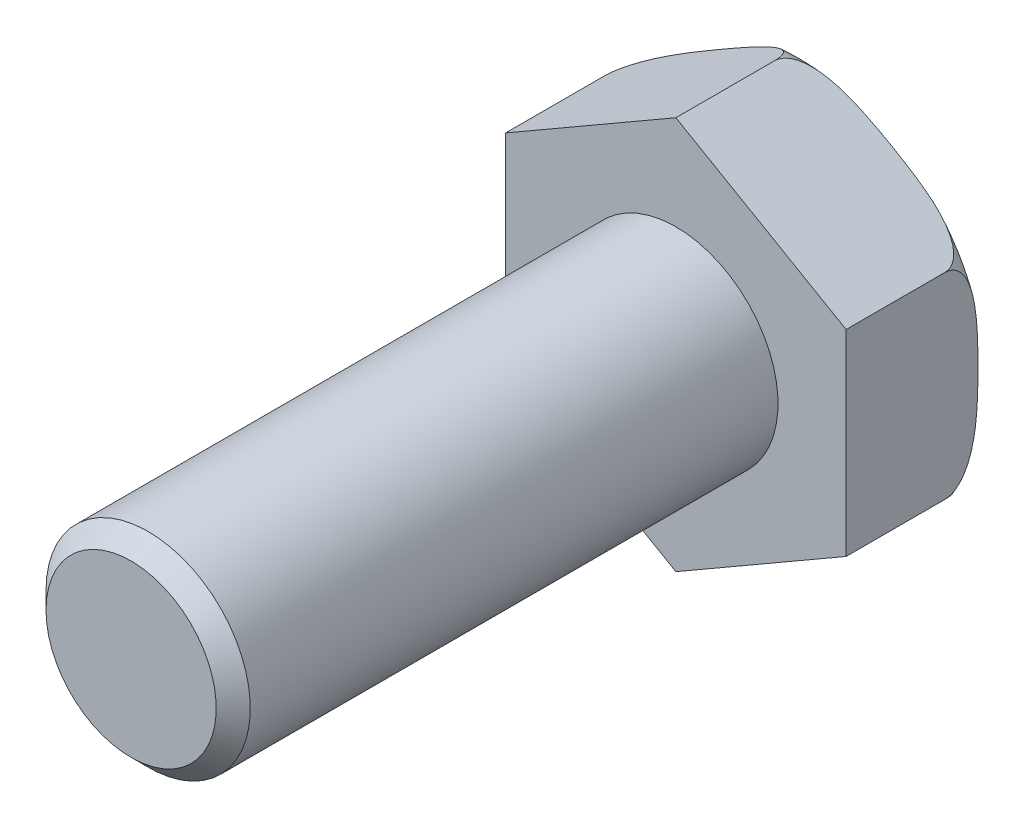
from build123d import *

# Parameters (mm, degrees)
TETE_DEPTH            = 3.9
PROFIL_CYLINDRE_R     = 3
CYLINDRE_FILETE_DEPTH = 16


with BuildPart() as part:
    # profil t_te → TETE (new body)
    with BuildSketch(Plane.XY):
        Polygon((-5, 2.886751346), (-5, -2.886751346), (0, -5.773502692), (5, -2.886751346), (5, 2.886751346), (0, 5.773502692), align=None)
    extrude(amount=TETE_DEPTH)

    # profil cong → CONGE (revolve, cut)
    with BuildSketch(Plane(origin=(0, 0, 0), x_dir=(0, 0, -1), z_dir=(1, 0, 0)), mode=Mode.PRIVATE) as conge_sk:
        with BuildLine():
            Line((-1, 5.773502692), (0, 5.773502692))
            Line((0, 5.773502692), (0, 4.773502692))
            ThreePointArc((0, 4.773502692), (-0.292893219, 5.480609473), (-1, 5.773502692))
        make_face()
    revolve(conge_sk.sketch.rotate(Axis((0, 0, 0), (0, 0, -1)), 90), axis=Axis((0, 0, 0), (0, 0, -1)), mode=Mode.SUBTRACT)

    # profil cylindre → CYLINDRE FILETE (add)
    with BuildSketch(Plane.XY.offset(3.9)):
        with Locations(Location((0, 0, 0), (0, 0, 180))):
            Circle(PROFIL_CYLINDRE_R)
    extrude(amount=CYLINDRE_FILETE_DEPTH)

    # profil chanfrein → CHANFREIN FILET (revolve, cut)
    with BuildSketch(Plane(origin=(0, 0, 0), x_dir=(0, 0, -1), z_dir=(1, 0, 0)), mode=Mode.PRIVATE) as chanfrein_filet_sk:
        Polygon((-19.9, 2.5), (-19.4, 3), (-19.9, 3), align=None)
    revolve(chanfrein_filet_sk.sketch.rotate(Axis((0, 0, 12.087417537), (0, 0, 1)), 90), axis=Axis((0, 0, 12.087417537), (0, 0, 1)), mode=Mode.SUBTRACT)


solid = part.part
